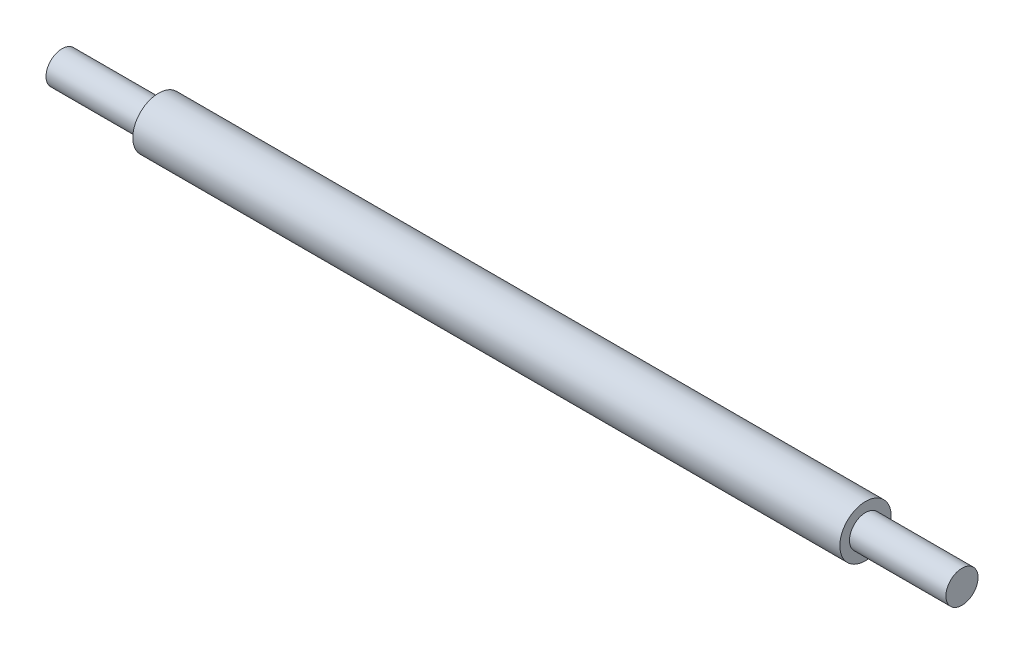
ISO-10303-21;
HEADER;
FILE_DESCRIPTION(('STEP AP214'),'2;1');
FILE_NAME('part.step','',(''),(''),'','','');
FILE_SCHEMA(('AUTOMOTIVE_DESIGN { 1 0 10303 214 1 1 1 1 }'));
ENDSEC;
DATA;
#1=APPLICATION_CONTEXT('core data for automotive mechanical design processes');
#2=APPLICATION_PROTOCOL_DEFINITION('international standard','automotive_design',2000,#1);
#3=PRODUCT_CONTEXT('',#1,'mechanical');
#4=PRODUCT('Part','Part','',(#3));
#5=PRODUCT_RELATED_PRODUCT_CATEGORY('part','',(#4));
#6=PRODUCT_DEFINITION_FORMATION('','',#4);
#7=PRODUCT_DEFINITION_CONTEXT('part definition',#1,'design');
#8=PRODUCT_DEFINITION('design','',#6,#7);
#9=PRODUCT_DEFINITION_SHAPE('','',#8);
#10=(LENGTH_UNIT() NAMED_UNIT(*) SI_UNIT(.MILLI.,.METRE.));
#11=(NAMED_UNIT(*) PLANE_ANGLE_UNIT() SI_UNIT($,.RADIAN.));
#12=(NAMED_UNIT(*) SI_UNIT($,.STERADIAN.) SOLID_ANGLE_UNIT());
#13=UNCERTAINTY_MEASURE_WITH_UNIT(LENGTH_MEASURE(1.E-05),#10,'distance_accuracy_value','');
#14=(GEOMETRIC_REPRESENTATION_CONTEXT(3) GLOBAL_UNCERTAINTY_ASSIGNED_CONTEXT((#13)) GLOBAL_UNIT_ASSIGNED_CONTEXT((#10,
#11,#12)) REPRESENTATION_CONTEXT('',''));
#15=CARTESIAN_POINT('',(0.,0.,0.));
#16=DIRECTION('',(0.,0.,1.));
#17=DIRECTION('',(1.,0.,0.));
#18=AXIS2_PLACEMENT_3D('',#15,#16,#17);
#19=CARTESIAN_POINT('',(0.,0.,0.));
#20=DIRECTION('',(1.,0.,0.));
#21=DIRECTION('',(0.,0.,-1.));
#22=AXIS2_PLACEMENT_3D('',#19,#20,#21);
#23=PLANE('',#22);
#24=CARTESIAN_POINT('',(0.,0.,0.));
#25=DIRECTION('',(-1.,0.,0.));
#26=DIRECTION('',(0.,0.,1.));
#27=AXIS2_PLACEMENT_3D('',#24,#25,#26);
#28=CIRCLE('',#27,1.5875);
#29=CARTESIAN_POINT('',(0.,0.,1.5875));
#30=VERTEX_POINT('',#29);
#31=EDGE_CURVE('E10',#30,#30,#28,.T.);
#32=ORIENTED_EDGE('',*,*,#31,.T.);
#33=EDGE_LOOP('',(#32));
#34=FACE_BOUND('',#33,.T.);
#35=ADVANCED_FACE('F31',(#34),#23,.F.);
#36=CARTESIAN_POINT('',(0.,0.,0.));
#37=DIRECTION('',(-1.,0.,0.));
#38=DIRECTION('',(0.,0.,1.));
#39=AXIS2_PLACEMENT_3D('',#36,#37,#38);
#40=CYLINDRICAL_SURFACE('',#39,1.5875);
#41=ORIENTED_EDGE('',*,*,#31,.F.);
#42=EDGE_LOOP('',(#41));
#43=FACE_BOUND('',#42,.T.);
#44=CARTESIAN_POINT('',(9.525,0.,0.));
#45=DIRECTION('',(-1.,0.,0.));
#46=DIRECTION('',(0.,0.,1.));
#47=AXIS2_PLACEMENT_3D('',#44,#45,#46);
#48=CIRCLE('',#47,1.5875);
#49=CARTESIAN_POINT('',(9.525,0.,1.5875));
#50=VERTEX_POINT('',#49);
#51=EDGE_CURVE('E37',#50,#50,#48,.T.);
#52=ORIENTED_EDGE('',*,*,#51,.T.);
#53=EDGE_LOOP('',(#52));
#54=FACE_BOUND('',#53,.T.);
#55=ADVANCED_FACE('F69',(#43,#54),#40,.T.);
#56=CARTESIAN_POINT('',(9.525,1.5875,0.));
#57=DIRECTION('',(1.,0.,0.));
#58=DIRECTION('',(0.,0.,-1.));
#59=AXIS2_PLACEMENT_3D('',#56,#57,#58);
#60=PLANE('',#59);
#61=ORIENTED_EDGE('',*,*,#51,.F.);
#62=EDGE_LOOP('',(#61));
#63=FACE_BOUND('',#62,.T.);
#64=CARTESIAN_POINT('',(9.525,0.,0.));
#65=DIRECTION('',(-1.,0.,0.));
#66=DIRECTION('',(0.,0.,1.));
#67=AXIS2_PLACEMENT_3D('',#64,#65,#66);
#68=CIRCLE('',#67,2.54);
#69=CARTESIAN_POINT('',(9.525,0.,2.54));
#70=VERTEX_POINT('',#69);
#71=EDGE_CURVE('E41',#70,#70,#68,.T.);
#72=ORIENTED_EDGE('',*,*,#71,.T.);
#73=EDGE_LOOP('',(#72));
#74=FACE_BOUND('',#73,.T.);
#75=ADVANCED_FACE('F73',(#63,#74),#60,.F.);
#76=CARTESIAN_POINT('',(0.,0.,0.));
#77=DIRECTION('',(-1.,0.,0.));
#78=DIRECTION('',(0.,0.,1.));
#79=AXIS2_PLACEMENT_3D('',#76,#77,#78);
#80=CYLINDRICAL_SURFACE('',#79,2.54);
#81=ORIENTED_EDGE('',*,*,#71,.F.);
#82=EDGE_LOOP('',(#81));
#83=FACE_BOUND('',#82,.T.);
#84=CARTESIAN_POINT('',(79.375,0.,0.));
#85=DIRECTION('',(-1.,0.,0.));
#86=DIRECTION('',(0.,0.,1.));
#87=AXIS2_PLACEMENT_3D('',#84,#85,#86);
#88=CIRCLE('',#87,2.54);
#89=CARTESIAN_POINT('',(79.375,0.,2.54));
#90=VERTEX_POINT('',#89);
#91=EDGE_CURVE('E45',#90,#90,#88,.T.);
#92=ORIENTED_EDGE('',*,*,#91,.T.);
#93=EDGE_LOOP('',(#92));
#94=FACE_BOUND('',#93,.T.);
#95=ADVANCED_FACE('F78',(#83,#94),#80,.T.);
#96=CARTESIAN_POINT('',(79.375,2.54,0.));
#97=DIRECTION('',(-1.,0.,0.));
#98=DIRECTION('',(0.,0.,1.));
#99=AXIS2_PLACEMENT_3D('',#96,#97,#98);
#100=PLANE('',#99);
#101=ORIENTED_EDGE('',*,*,#91,.F.);
#102=EDGE_LOOP('',(#101));
#103=FACE_BOUND('',#102,.T.);
#104=CARTESIAN_POINT('',(79.375,0.,0.));
#105=DIRECTION('',(-1.,0.,0.));
#106=DIRECTION('',(0.,0.,1.));
#107=AXIS2_PLACEMENT_3D('',#104,#105,#106);
#108=CIRCLE('',#107,1.5875);
#109=CARTESIAN_POINT('',(79.375,0.,1.5875));
#110=VERTEX_POINT('',#109);
#111=EDGE_CURVE('E50',#110,#110,#108,.T.);
#112=ORIENTED_EDGE('',*,*,#111,.T.);
#113=EDGE_LOOP('',(#112));
#114=FACE_BOUND('',#113,.T.);
#115=ADVANCED_FACE('F65',(#103,#114),#100,.F.);
#116=CARTESIAN_POINT('',(0.,0.,0.));
#117=DIRECTION('',(-1.,0.,0.));
#118=DIRECTION('',(0.,0.,1.));
#119=AXIS2_PLACEMENT_3D('',#116,#117,#118);
#120=CYLINDRICAL_SURFACE('',#119,1.5875);
#121=ORIENTED_EDGE('',*,*,#111,.F.);
#122=EDGE_LOOP('',(#121));
#123=FACE_BOUND('',#122,.T.);
#124=CARTESIAN_POINT('',(88.9,0.,0.));
#125=DIRECTION('',(-1.,0.,0.));
#126=DIRECTION('',(0.,0.,1.));
#127=AXIS2_PLACEMENT_3D('',#124,#125,#126);
#128=CIRCLE('',#127,1.5875);
#129=CARTESIAN_POINT('',(88.9,0.,1.5875));
#130=VERTEX_POINT('',#129);
#131=EDGE_CURVE('E53',#130,#130,#128,.T.);
#132=ORIENTED_EDGE('',*,*,#131,.T.);
#133=EDGE_LOOP('',(#132));
#134=FACE_BOUND('',#133,.T.);
#135=ADVANCED_FACE('F57',(#123,#134),#120,.T.);
#136=CARTESIAN_POINT('',(88.9,1.5875,0.));
#137=DIRECTION('',(-1.,0.,0.));
#138=DIRECTION('',(0.,0.,1.));
#139=AXIS2_PLACEMENT_3D('',#136,#137,#138);
#140=PLANE('',#139);
#141=ORIENTED_EDGE('',*,*,#131,.F.);
#142=EDGE_LOOP('',(#141));
#143=FACE_BOUND('',#142,.T.);
#144=ADVANCED_FACE('F59',(#143),#140,.F.);
#145=CLOSED_SHELL('',(#35,#55,#75,#95,#115,#135,#144));
#146=MANIFOLD_SOLID_BREP('B2',#145);
#147=ADVANCED_BREP_SHAPE_REPRESENTATION('',(#18,#146),#14);
#148=SHAPE_DEFINITION_REPRESENTATION(#9,#147);
ENDSEC;
END-ISO-10303-21;
